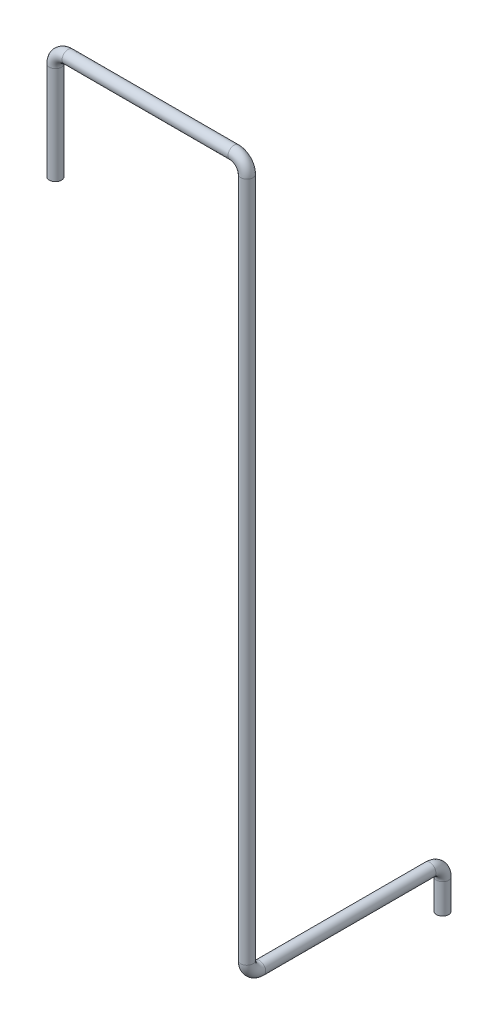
ISO-10303-21;
HEADER;
FILE_DESCRIPTION(('STEP AP214'),'2;1');
FILE_NAME('part.step','',(''),(''),'','','');
FILE_SCHEMA(('AUTOMOTIVE_DESIGN { 1 0 10303 214 1 1 1 1 }'));
ENDSEC;
DATA;
#1=APPLICATION_CONTEXT('core data for automotive mechanical design processes');
#2=APPLICATION_PROTOCOL_DEFINITION('international standard','automotive_design',2000,#1);
#3=PRODUCT_CONTEXT('',#1,'mechanical');
#4=PRODUCT('Part','Part','',(#3));
#5=PRODUCT_RELATED_PRODUCT_CATEGORY('part','',(#4));
#6=PRODUCT_DEFINITION_FORMATION('','',#4);
#7=PRODUCT_DEFINITION_CONTEXT('part definition',#1,'design');
#8=PRODUCT_DEFINITION('design','',#6,#7);
#9=PRODUCT_DEFINITION_SHAPE('','',#8);
#10=(LENGTH_UNIT() NAMED_UNIT(*) SI_UNIT(.MILLI.,.METRE.));
#11=(NAMED_UNIT(*) PLANE_ANGLE_UNIT() SI_UNIT($,.RADIAN.));
#12=(NAMED_UNIT(*) SI_UNIT($,.STERADIAN.) SOLID_ANGLE_UNIT());
#13=UNCERTAINTY_MEASURE_WITH_UNIT(LENGTH_MEASURE(1.E-05),#10,'distance_accuracy_value','');
#14=(GEOMETRIC_REPRESENTATION_CONTEXT(3) GLOBAL_UNCERTAINTY_ASSIGNED_CONTEXT((#13)) GLOBAL_UNIT_ASSIGNED_CONTEXT((#10,
#11,#12)) REPRESENTATION_CONTEXT('',''));
#15=CARTESIAN_POINT('',(0.,0.,0.));
#16=DIRECTION('',(0.,0.,1.));
#17=DIRECTION('',(1.,0.,0.));
#18=AXIS2_PLACEMENT_3D('',#15,#16,#17);
#19=CARTESIAN_POINT('',(-450.,1730.,460.));
#20=DIRECTION('',(0.,-1.,0.));
#21=DIRECTION('',(0.,0.,-1.));
#22=AXIS2_PLACEMENT_3D('',#19,#20,#21);
#23=CYLINDRICAL_SURFACE('',#22,14.3);
#24=CARTESIAN_POINT('',(-450.,1730.,460.));
#25=DIRECTION('',(0.,-1.,0.));
#26=DIRECTION('',(0.,0.,1.));
#27=AXIS2_PLACEMENT_3D('',#24,#25,#26);
#28=CIRCLE('',#27,14.3);
#29=CARTESIAN_POINT('',(-464.3,1730.,460.));
#30=VERTEX_POINT('',#29);
#31=EDGE_CURVE('E43',#30,#30,#28,.T.);
#32=ORIENTED_EDGE('',*,*,#31,.T.);
#33=EDGE_LOOP('',(#32));
#34=FACE_BOUND('',#33,.T.);
#35=CARTESIAN_POINT('',(-450.,1500.,460.));
#36=DIRECTION('',(0.,-1.,0.));
#37=DIRECTION('',(0.,0.,1.));
#38=AXIS2_PLACEMENT_3D('',#35,#36,#37);
#39=CIRCLE('',#38,14.3);
#40=CARTESIAN_POINT('',(-450.,1500.,474.3));
#41=VERTEX_POINT('',#40);
#42=EDGE_CURVE('E10',#41,#41,#39,.T.);
#43=ORIENTED_EDGE('',*,*,#42,.F.);
#44=EDGE_LOOP('',(#43));
#45=FACE_BOUND('',#44,.T.);
#46=ADVANCED_FACE('F33',(#34,#45),#23,.T.);
#47=CARTESIAN_POINT('',(-450.,1730.,460.));
#48=DIRECTION('',(0.,-1.,0.));
#49=DIRECTION('',(0.,0.,-1.));
#50=AXIS2_PLACEMENT_3D('',#47,#48,#49);
#51=CYLINDRICAL_SURFACE('',#50,12.7);
#52=CARTESIAN_POINT('',(-450.,1730.,460.));
#53=DIRECTION('',(0.,-1.,0.));
#54=DIRECTION('',(0.,0.,1.));
#55=AXIS2_PLACEMENT_3D('',#52,#53,#54);
#56=CIRCLE('',#55,12.7);
#57=CARTESIAN_POINT('',(-462.7,1730.,460.));
#58=VERTEX_POINT('',#57);
#59=EDGE_CURVE('E47',#58,#58,#56,.T.);
#60=ORIENTED_EDGE('',*,*,#59,.F.);
#61=EDGE_LOOP('',(#60));
#62=FACE_BOUND('',#61,.T.);
#63=CARTESIAN_POINT('',(-450.,1500.,460.));
#64=DIRECTION('',(0.,-1.,0.));
#65=DIRECTION('',(0.,0.,1.));
#66=AXIS2_PLACEMENT_3D('',#63,#64,#65);
#67=CIRCLE('',#66,12.7);
#68=CARTESIAN_POINT('',(-450.,1500.,472.7));
#69=VERTEX_POINT('',#68);
#70=EDGE_CURVE('E39',#69,#69,#67,.T.);
#71=ORIENTED_EDGE('',*,*,#70,.T.);
#72=EDGE_LOOP('',(#71));
#73=FACE_BOUND('',#72,.T.);
#74=ADVANCED_FACE('F153',(#62,#73),#51,.F.);
#75=CARTESIAN_POINT('',(-420.,1730.,460.));
#76=DIRECTION('',(0.,0.,1.));
#77=DIRECTION('',(1.,0.,0.));
#78=AXIS2_PLACEMENT_3D('',#75,#76,#77);
#79=TOROIDAL_SURFACE('',#78,29.9999999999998,14.3);
#80=CARTESIAN_POINT('',(-420.,1760.,460.));
#81=DIRECTION('',(-1.,0.,0.));
#82=DIRECTION('',(0.,0.,1.));
#83=AXIS2_PLACEMENT_3D('',#80,#81,#82);
#84=CIRCLE('',#83,14.3);
#85=CARTESIAN_POINT('',(-420.,1774.3,460.));
#86=VERTEX_POINT('',#85);
#87=EDGE_CURVE('E52',#86,#86,#84,.T.);
#88=CARTESIAN_POINT('',(-420.,1730.,460.));
#89=DIRECTION('',(0.,0.,1.));
#90=DIRECTION('',(1.,0.,0.));
#91=AXIS2_PLACEMENT_3D('',#88,#89,#90);
#92=CIRCLE('',#91,44.2999999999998);
#93=EDGE_CURVE('',#86,#30,#92,.T.);
#94=ORIENTED_EDGE('',*,*,#87,.T.);
#95=ORIENTED_EDGE('',*,*,#31,.F.);
#96=ORIENTED_EDGE('',*,*,#93,.T.);
#97=ORIENTED_EDGE('',*,*,#93,.F.);
#98=EDGE_LOOP('',(#94,#96,#95,#97));
#99=FACE_BOUND('',#98,.T.);
#100=ADVANCED_FACE('F149',(#99),#79,.T.);
#101=CARTESIAN_POINT('',(-420.,1730.,460.));
#102=DIRECTION('',(0.,0.,1.));
#103=DIRECTION('',(1.,0.,0.));
#104=AXIS2_PLACEMENT_3D('',#101,#102,#103);
#105=TOROIDAL_SURFACE('',#104,29.9999999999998,12.7);
#106=CARTESIAN_POINT('',(-420.,1760.,460.));
#107=DIRECTION('',(-1.,0.,0.));
#108=DIRECTION('',(0.,0.,1.));
#109=AXIS2_PLACEMENT_3D('',#106,#107,#108);
#110=CIRCLE('',#109,12.7);
#111=CARTESIAN_POINT('',(-420.,1772.7,460.));
#112=VERTEX_POINT('',#111);
#113=EDGE_CURVE('E55',#112,#112,#110,.T.);
#114=CARTESIAN_POINT('',(-420.,1730.,460.));
#115=DIRECTION('',(0.,0.,1.));
#116=DIRECTION('',(1.,0.,0.));
#117=AXIS2_PLACEMENT_3D('',#114,#115,#116);
#118=CIRCLE('',#117,42.6999999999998);
#119=EDGE_CURVE('',#112,#58,#118,.T.);
#120=ORIENTED_EDGE('',*,*,#113,.F.);
#121=ORIENTED_EDGE('',*,*,#59,.T.);
#122=ORIENTED_EDGE('',*,*,#119,.T.);
#123=ORIENTED_EDGE('',*,*,#119,.F.);
#124=EDGE_LOOP('',(#120,#122,#121,#123));
#125=FACE_BOUND('',#124,.T.);
#126=ADVANCED_FACE('F146',(#125),#105,.F.);
#127=CARTESIAN_POINT('',(-30.,1760.,460.));
#128=DIRECTION('',(-1.,0.,0.));
#129=DIRECTION('',(0.,-1.,0.));
#130=AXIS2_PLACEMENT_3D('',#127,#128,#129);
#131=CYLINDRICAL_SURFACE('',#130,14.3);
#132=CARTESIAN_POINT('',(-30.,1760.,460.));
#133=DIRECTION('',(-1.,0.,0.));
#134=DIRECTION('',(0.,0.,1.));
#135=AXIS2_PLACEMENT_3D('',#132,#133,#134);
#136=CIRCLE('',#135,14.3);
#137=CARTESIAN_POINT('',(-30.,1774.3,460.));
#138=VERTEX_POINT('',#137);
#139=EDGE_CURVE('E58',#138,#138,#136,.T.);
#140=ORIENTED_EDGE('',*,*,#139,.T.);
#141=EDGE_LOOP('',(#140));
#142=FACE_BOUND('',#141,.T.);
#143=ORIENTED_EDGE('',*,*,#87,.F.);
#144=EDGE_LOOP('',(#143));
#145=FACE_BOUND('',#144,.T.);
#146=ADVANCED_FACE('F142',(#142,#145),#131,.T.);
#147=CARTESIAN_POINT('',(-30.,1760.,460.));
#148=DIRECTION('',(-1.,0.,0.));
#149=DIRECTION('',(0.,-1.,0.));
#150=AXIS2_PLACEMENT_3D('',#147,#148,#149);
#151=CYLINDRICAL_SURFACE('',#150,12.7);
#152=CARTESIAN_POINT('',(-30.,1760.,460.));
#153=DIRECTION('',(-1.,0.,0.));
#154=DIRECTION('',(0.,0.,1.));
#155=AXIS2_PLACEMENT_3D('',#152,#153,#154);
#156=CIRCLE('',#155,12.7);
#157=CARTESIAN_POINT('',(-30.,1772.7,460.));
#158=VERTEX_POINT('',#157);
#159=EDGE_CURVE('E61',#158,#158,#156,.T.);
#160=ORIENTED_EDGE('',*,*,#159,.F.);
#161=EDGE_LOOP('',(#160));
#162=FACE_BOUND('',#161,.T.);
#163=ORIENTED_EDGE('',*,*,#113,.T.);
#164=EDGE_LOOP('',(#163));
#165=FACE_BOUND('',#164,.T.);
#166=ADVANCED_FACE('F139',(#162,#165),#151,.F.);
#167=CARTESIAN_POINT('',(-30.,1730.,460.));
#168=DIRECTION('',(0.,0.,1.));
#169=DIRECTION('',(1.,0.,0.));
#170=AXIS2_PLACEMENT_3D('',#167,#168,#169);
#171=TOROIDAL_SURFACE('',#170,30.,14.3);
#172=CARTESIAN_POINT('',(0.,1730.,460.));
#173=DIRECTION('',(0.,1.,0.));
#174=DIRECTION('',(0.,0.,1.));
#175=AXIS2_PLACEMENT_3D('',#172,#173,#174);
#176=CIRCLE('',#175,14.3);
#177=CARTESIAN_POINT('',(14.3,1730.,460.));
#178=VERTEX_POINT('',#177);
#179=EDGE_CURVE('E64',#178,#178,#176,.T.);
#180=CARTESIAN_POINT('',(-30.,1730.,460.));
#181=DIRECTION('',(0.,0.,1.));
#182=DIRECTION('',(1.,0.,0.));
#183=AXIS2_PLACEMENT_3D('',#180,#181,#182);
#184=CIRCLE('',#183,44.3);
#185=EDGE_CURVE('',#178,#138,#184,.T.);
#186=ORIENTED_EDGE('',*,*,#179,.T.);
#187=ORIENTED_EDGE('',*,*,#139,.F.);
#188=ORIENTED_EDGE('',*,*,#185,.T.);
#189=ORIENTED_EDGE('',*,*,#185,.F.);
#190=EDGE_LOOP('',(#186,#188,#187,#189));
#191=FACE_BOUND('',#190,.T.);
#192=ADVANCED_FACE('F135',(#191),#171,.T.);
#193=CARTESIAN_POINT('',(-30.,1730.,460.));
#194=DIRECTION('',(0.,0.,1.));
#195=DIRECTION('',(1.,0.,0.));
#196=AXIS2_PLACEMENT_3D('',#193,#194,#195);
#197=TOROIDAL_SURFACE('',#196,30.,12.7);
#198=CARTESIAN_POINT('',(0.,1730.,460.));
#199=DIRECTION('',(0.,1.,0.));
#200=DIRECTION('',(0.,0.,1.));
#201=AXIS2_PLACEMENT_3D('',#198,#199,#200);
#202=CIRCLE('',#201,12.7);
#203=CARTESIAN_POINT('',(12.7,1730.,460.));
#204=VERTEX_POINT('',#203);
#205=EDGE_CURVE('E67',#204,#204,#202,.T.);
#206=CARTESIAN_POINT('',(-30.,1730.,460.));
#207=DIRECTION('',(0.,0.,1.));
#208=DIRECTION('',(1.,0.,0.));
#209=AXIS2_PLACEMENT_3D('',#206,#207,#208);
#210=CIRCLE('',#209,42.7);
#211=EDGE_CURVE('',#204,#158,#210,.T.);
#212=ORIENTED_EDGE('',*,*,#205,.F.);
#213=ORIENTED_EDGE('',*,*,#159,.T.);
#214=ORIENTED_EDGE('',*,*,#211,.T.);
#215=ORIENTED_EDGE('',*,*,#211,.F.);
#216=EDGE_LOOP('',(#212,#214,#213,#215));
#217=FACE_BOUND('',#216,.T.);
#218=ADVANCED_FACE('F132',(#217),#197,.F.);
#219=CARTESIAN_POINT('',(0.,130.,460.));
#220=DIRECTION('',(0.,1.,0.));
#221=DIRECTION('',(0.,0.,1.));
#222=AXIS2_PLACEMENT_3D('',#219,#220,#221);
#223=CYLINDRICAL_SURFACE('',#222,14.3);
#224=CARTESIAN_POINT('',(0.,130.,460.));
#225=DIRECTION('',(0.,1.,0.));
#226=DIRECTION('',(0.,0.,1.));
#227=AXIS2_PLACEMENT_3D('',#224,#225,#226);
#228=CIRCLE('',#227,14.3);
#229=CARTESIAN_POINT('',(0.,130.,474.3));
#230=VERTEX_POINT('',#229);
#231=EDGE_CURVE('E70',#230,#230,#228,.T.);
#232=ORIENTED_EDGE('',*,*,#231,.T.);
#233=EDGE_LOOP('',(#232));
#234=FACE_BOUND('',#233,.T.);
#235=ORIENTED_EDGE('',*,*,#179,.F.);
#236=EDGE_LOOP('',(#235));
#237=FACE_BOUND('',#236,.T.);
#238=ADVANCED_FACE('F128',(#234,#237),#223,.T.);
#239=CARTESIAN_POINT('',(0.,130.,460.));
#240=DIRECTION('',(0.,1.,0.));
#241=DIRECTION('',(0.,0.,1.));
#242=AXIS2_PLACEMENT_3D('',#239,#240,#241);
#243=CYLINDRICAL_SURFACE('',#242,12.7);
#244=CARTESIAN_POINT('',(0.,130.,460.));
#245=DIRECTION('',(0.,1.,0.));
#246=DIRECTION('',(0.,0.,1.));
#247=AXIS2_PLACEMENT_3D('',#244,#245,#246);
#248=CIRCLE('',#247,12.7);
#249=CARTESIAN_POINT('',(0.,130.,472.7));
#250=VERTEX_POINT('',#249);
#251=EDGE_CURVE('E73',#250,#250,#248,.T.);
#252=ORIENTED_EDGE('',*,*,#251,.F.);
#253=EDGE_LOOP('',(#252));
#254=FACE_BOUND('',#253,.T.);
#255=ORIENTED_EDGE('',*,*,#205,.T.);
#256=EDGE_LOOP('',(#255));
#257=FACE_BOUND('',#256,.T.);
#258=ADVANCED_FACE('F125',(#254,#257),#243,.F.);
#259=CARTESIAN_POINT('',(0.,130.,430.));
#260=DIRECTION('',(-1.,0.,0.));
#261=DIRECTION('',(0.,0.,1.));
#262=AXIS2_PLACEMENT_3D('',#259,#260,#261);
#263=TOROIDAL_SURFACE('',#262,30.,14.3);
#264=CARTESIAN_POINT('',(0.,100.,430.));
#265=DIRECTION('',(0.,0.,1.));
#266=DIRECTION('',(0.,-1.,0.));
#267=AXIS2_PLACEMENT_3D('',#264,#265,#266);
#268=CIRCLE('',#267,14.3);
#269=CARTESIAN_POINT('',(0.,85.7,430.));
#270=VERTEX_POINT('',#269);
#271=EDGE_CURVE('E76',#270,#270,#268,.T.);
#272=CARTESIAN_POINT('',(0.,130.,430.));
#273=DIRECTION('',(-1.,0.,0.));
#274=DIRECTION('',(0.,0.,1.));
#275=AXIS2_PLACEMENT_3D('',#272,#273,#274);
#276=CIRCLE('',#275,44.3);
#277=EDGE_CURVE('',#270,#230,#276,.T.);
#278=ORIENTED_EDGE('',*,*,#271,.T.);
#279=ORIENTED_EDGE('',*,*,#231,.F.);
#280=ORIENTED_EDGE('',*,*,#277,.T.);
#281=ORIENTED_EDGE('',*,*,#277,.F.);
#282=EDGE_LOOP('',(#278,#280,#279,#281));
#283=FACE_BOUND('',#282,.T.);
#284=ADVANCED_FACE('F121',(#283),#263,.T.);
#285=CARTESIAN_POINT('',(0.,130.,430.));
#286=DIRECTION('',(-1.,0.,0.));
#287=DIRECTION('',(0.,0.,1.));
#288=AXIS2_PLACEMENT_3D('',#285,#286,#287);
#289=TOROIDAL_SURFACE('',#288,30.,12.7);
#290=CARTESIAN_POINT('',(0.,100.,430.));
#291=DIRECTION('',(0.,0.,1.));
#292=DIRECTION('',(0.,-1.,0.));
#293=AXIS2_PLACEMENT_3D('',#290,#291,#292);
#294=CIRCLE('',#293,12.7);
#295=CARTESIAN_POINT('',(0.,87.3,430.));
#296=VERTEX_POINT('',#295);
#297=EDGE_CURVE('E79',#296,#296,#294,.T.);
#298=CARTESIAN_POINT('',(0.,130.,430.));
#299=DIRECTION('',(-1.,0.,0.));
#300=DIRECTION('',(0.,0.,1.));
#301=AXIS2_PLACEMENT_3D('',#298,#299,#300);
#302=CIRCLE('',#301,42.7);
#303=EDGE_CURVE('',#296,#250,#302,.T.);
#304=ORIENTED_EDGE('',*,*,#297,.F.);
#305=ORIENTED_EDGE('',*,*,#251,.T.);
#306=ORIENTED_EDGE('',*,*,#303,.T.);
#307=ORIENTED_EDGE('',*,*,#303,.F.);
#308=EDGE_LOOP('',(#304,#306,#305,#307));
#309=FACE_BOUND('',#308,.T.);
#310=ADVANCED_FACE('F118',(#309),#289,.F.);
#311=CARTESIAN_POINT('',(0.,100.,30.));
#312=DIRECTION('',(0.,0.,1.));
#313=DIRECTION('',(1.,0.,0.));
#314=AXIS2_PLACEMENT_3D('',#311,#312,#313);
#315=CYLINDRICAL_SURFACE('',#314,14.3);
#316=CARTESIAN_POINT('',(0.,100.,30.));
#317=DIRECTION('',(0.,0.,1.));
#318=DIRECTION('',(0.,-1.,0.));
#319=AXIS2_PLACEMENT_3D('',#316,#317,#318);
#320=CIRCLE('',#319,14.3);
#321=CARTESIAN_POINT('',(0.,114.3,30.));
#322=VERTEX_POINT('',#321);
#323=EDGE_CURVE('E82',#322,#322,#320,.T.);
#324=ORIENTED_EDGE('',*,*,#323,.T.);
#325=EDGE_LOOP('',(#324));
#326=FACE_BOUND('',#325,.T.);
#327=ORIENTED_EDGE('',*,*,#271,.F.);
#328=EDGE_LOOP('',(#327));
#329=FACE_BOUND('',#328,.T.);
#330=ADVANCED_FACE('F114',(#326,#329),#315,.T.);
#331=CARTESIAN_POINT('',(0.,100.,30.));
#332=DIRECTION('',(0.,0.,1.));
#333=DIRECTION('',(1.,0.,0.));
#334=AXIS2_PLACEMENT_3D('',#331,#332,#333);
#335=CYLINDRICAL_SURFACE('',#334,12.7);
#336=CARTESIAN_POINT('',(0.,100.,30.));
#337=DIRECTION('',(0.,0.,1.));
#338=DIRECTION('',(0.,-1.,0.));
#339=AXIS2_PLACEMENT_3D('',#336,#337,#338);
#340=CIRCLE('',#339,12.7);
#341=CARTESIAN_POINT('',(0.,112.7,30.));
#342=VERTEX_POINT('',#341);
#343=EDGE_CURVE('E85',#342,#342,#340,.T.);
#344=ORIENTED_EDGE('',*,*,#343,.F.);
#345=EDGE_LOOP('',(#344));
#346=FACE_BOUND('',#345,.T.);
#347=ORIENTED_EDGE('',*,*,#297,.T.);
#348=EDGE_LOOP('',(#347));
#349=FACE_BOUND('',#348,.T.);
#350=ADVANCED_FACE('F111',(#346,#349),#335,.F.);
#351=CARTESIAN_POINT('',(0.,70.,30.));
#352=DIRECTION('',(1.,0.,0.));
#353=DIRECTION('',(0.,0.,-1.));
#354=AXIS2_PLACEMENT_3D('',#351,#352,#353);
#355=TOROIDAL_SURFACE('',#354,30.,14.3);
#356=CARTESIAN_POINT('',(0.,70.,0.));
#357=DIRECTION('',(0.,1.,0.));
#358=DIRECTION('',(0.,0.,1.));
#359=AXIS2_PLACEMENT_3D('',#356,#357,#358);
#360=CIRCLE('',#359,14.3);
#361=CARTESIAN_POINT('',(0.,70.,-14.3));
#362=VERTEX_POINT('',#361);
#363=EDGE_CURVE('E88',#362,#362,#360,.T.);
#364=CARTESIAN_POINT('',(0.,70.,30.));
#365=DIRECTION('',(1.,0.,0.));
#366=DIRECTION('',(0.,0.,-1.));
#367=AXIS2_PLACEMENT_3D('',#364,#365,#366);
#368=CIRCLE('',#367,44.3);
#369=EDGE_CURVE('',#362,#322,#368,.T.);
#370=ORIENTED_EDGE('',*,*,#363,.T.);
#371=ORIENTED_EDGE('',*,*,#323,.F.);
#372=ORIENTED_EDGE('',*,*,#369,.T.);
#373=ORIENTED_EDGE('',*,*,#369,.F.);
#374=EDGE_LOOP('',(#370,#372,#371,#373));
#375=FACE_BOUND('',#374,.T.);
#376=ADVANCED_FACE('F107',(#375),#355,.T.);
#377=CARTESIAN_POINT('',(0.,70.,30.));
#378=DIRECTION('',(1.,0.,0.));
#379=DIRECTION('',(0.,0.,-1.));
#380=AXIS2_PLACEMENT_3D('',#377,#378,#379);
#381=TOROIDAL_SURFACE('',#380,30.,12.7);
#382=CARTESIAN_POINT('',(0.,70.,0.));
#383=DIRECTION('',(0.,1.,0.));
#384=DIRECTION('',(0.,0.,1.));
#385=AXIS2_PLACEMENT_3D('',#382,#383,#384);
#386=CIRCLE('',#385,12.7);
#387=CARTESIAN_POINT('',(0.,70.,-12.7));
#388=VERTEX_POINT('',#387);
#389=EDGE_CURVE('E92',#388,#388,#386,.T.);
#390=CARTESIAN_POINT('',(0.,70.,30.));
#391=DIRECTION('',(1.,0.,0.));
#392=DIRECTION('',(0.,0.,-1.));
#393=AXIS2_PLACEMENT_3D('',#390,#391,#392);
#394=CIRCLE('',#393,42.7);
#395=EDGE_CURVE('',#388,#342,#394,.T.);
#396=ORIENTED_EDGE('',*,*,#389,.F.);
#397=ORIENTED_EDGE('',*,*,#343,.T.);
#398=ORIENTED_EDGE('',*,*,#395,.T.);
#399=ORIENTED_EDGE('',*,*,#395,.F.);
#400=EDGE_LOOP('',(#396,#398,#397,#399));
#401=FACE_BOUND('',#400,.T.);
#402=ADVANCED_FACE('F104',(#401),#381,.F.);
#403=CARTESIAN_POINT('',(0.,70.,0.));
#404=DIRECTION('',(0.,-1.,0.));
#405=DIRECTION('',(0.,0.,-1.));
#406=AXIS2_PLACEMENT_3D('',#403,#404,#405);
#407=CYLINDRICAL_SURFACE('',#406,12.7);
#408=ORIENTED_EDGE('',*,*,#389,.T.);
#409=EDGE_LOOP('',(#408));
#410=FACE_BOUND('',#409,.T.);
#411=CARTESIAN_POINT('',(0.,0.,0.));
#412=DIRECTION('',(0.,1.,0.));
#413=DIRECTION('',(0.,0.,1.));
#414=AXIS2_PLACEMENT_3D('',#411,#412,#413);
#415=CIRCLE('',#414,12.7);
#416=CARTESIAN_POINT('',(0.,0.,12.7));
#417=VERTEX_POINT('',#416);
#418=EDGE_CURVE('E93',#417,#417,#415,.T.);
#419=ORIENTED_EDGE('',*,*,#418,.F.);
#420=EDGE_LOOP('',(#419));
#421=FACE_BOUND('',#420,.T.);
#422=ADVANCED_FACE('F101',(#410,#421),#407,.F.);
#423=CARTESIAN_POINT('',(0.,70.,0.));
#424=DIRECTION('',(0.,-1.,0.));
#425=DIRECTION('',(0.,0.,-1.));
#426=AXIS2_PLACEMENT_3D('',#423,#424,#425);
#427=CYLINDRICAL_SURFACE('',#426,14.3);
#428=ORIENTED_EDGE('',*,*,#363,.F.);
#429=EDGE_LOOP('',(#428));
#430=FACE_BOUND('',#429,.T.);
#431=CARTESIAN_POINT('',(0.,0.,0.));
#432=DIRECTION('',(0.,1.,0.));
#433=DIRECTION('',(0.,0.,1.));
#434=AXIS2_PLACEMENT_3D('',#431,#432,#433);
#435=CIRCLE('',#434,14.3);
#436=CARTESIAN_POINT('',(0.,0.,14.3));
#437=VERTEX_POINT('',#436);
#438=EDGE_CURVE('E89',#437,#437,#435,.T.);
#439=ORIENTED_EDGE('',*,*,#438,.T.);
#440=EDGE_LOOP('',(#439));
#441=FACE_BOUND('',#440,.T.);
#442=ADVANCED_FACE('F183',(#430,#441),#427,.T.);
#443=CARTESIAN_POINT('',(-450.,1500.,460.));
#444=DIRECTION('',(0.,-1.,0.));
#445=DIRECTION('',(0.,0.,1.));
#446=AXIS2_PLACEMENT_3D('',#443,#444,#445);
#447=PLANE('',#446);
#448=ORIENTED_EDGE('',*,*,#70,.F.);
#449=EDGE_LOOP('',(#448));
#450=FACE_BOUND('',#449,.T.);
#451=ORIENTED_EDGE('',*,*,#42,.T.);
#452=EDGE_LOOP('',(#451));
#453=FACE_BOUND('',#452,.T.);
#454=ADVANCED_FACE('F186',(#450,#453),#447,.T.);
#455=CARTESIAN_POINT('',(0.,0.,0.));
#456=DIRECTION('',(0.,1.,0.));
#457=DIRECTION('',(0.,0.,1.));
#458=AXIS2_PLACEMENT_3D('',#455,#456,#457);
#459=PLANE('',#458);
#460=ORIENTED_EDGE('',*,*,#418,.T.);
#461=EDGE_LOOP('',(#460));
#462=FACE_BOUND('',#461,.T.);
#463=ORIENTED_EDGE('',*,*,#438,.F.);
#464=EDGE_LOOP('',(#463));
#465=FACE_BOUND('',#464,.T.);
#466=ADVANCED_FACE('F188',(#462,#465),#459,.F.);
#467=CLOSED_SHELL('',(#46,#74,#100,#126,#146,#166,#192,#218,#238,#258,#284,#310,#330,#350,#376,
#402,#422,#442,#454,#466));
#468=MANIFOLD_SOLID_BREP('B2',#467);
#469=ADVANCED_BREP_SHAPE_REPRESENTATION('',(#18,#468),#14);
#470=SHAPE_DEFINITION_REPRESENTATION(#9,#469);
ENDSEC;
END-ISO-10303-21;
